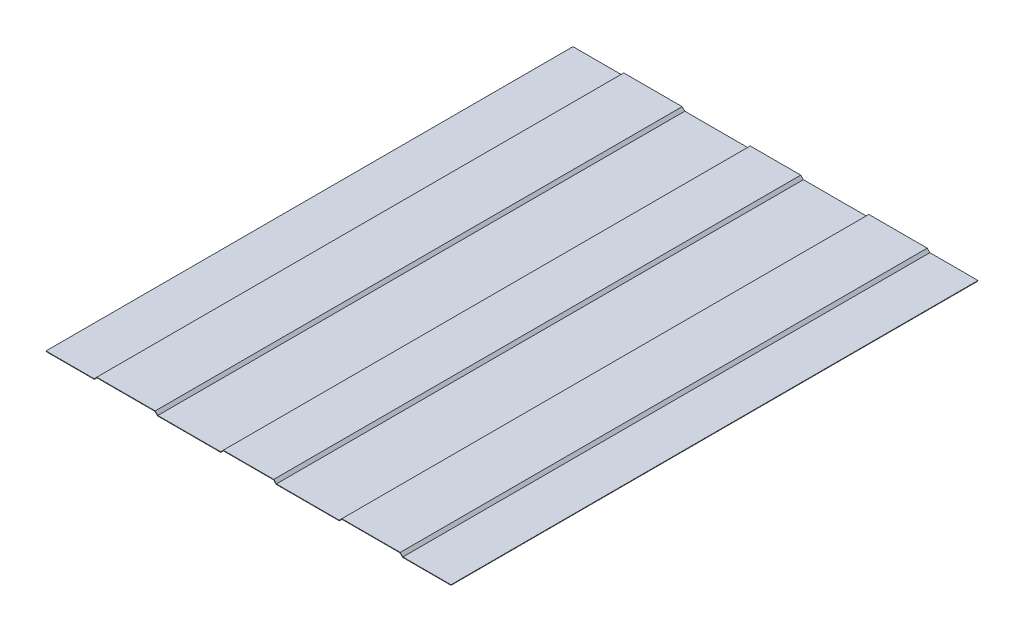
from build123d import *

# Parameters (mm, degrees)
EXTRU_MINCE1_DEPTH = 1000


with BuildPart() as part:
    # Esquisse1 → Extru.-Mince1 (new body)
    with BuildSketch(Plane.XY):
        Polygon((-384.25, 0), (-292.5, 0), (-287.5, 5), (-177.5, 5), (-172.5, 0), (-52.5, 0), (-47.5, 5), (47.5, 5), (52.5, 0), (172.5, 0), (177.5, 5), (287.5, 5), (292.5, 0), (384.25, 0), (384.25, 1), (292.914213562, 1), (287.914213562, 6), (177.085786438, 6), (172.085786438, 1), (52.914213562, 1), (47.914213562, 6), (-47.914213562, 6), (-52.914213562, 1), (-172.085786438, 1), (-177.085786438, 6), (-287.914213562, 6), (-292.914213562, 1), (-384.25, 1), align=None)
    extrude(amount=EXTRU_MINCE1_DEPTH)


solid = part.part
